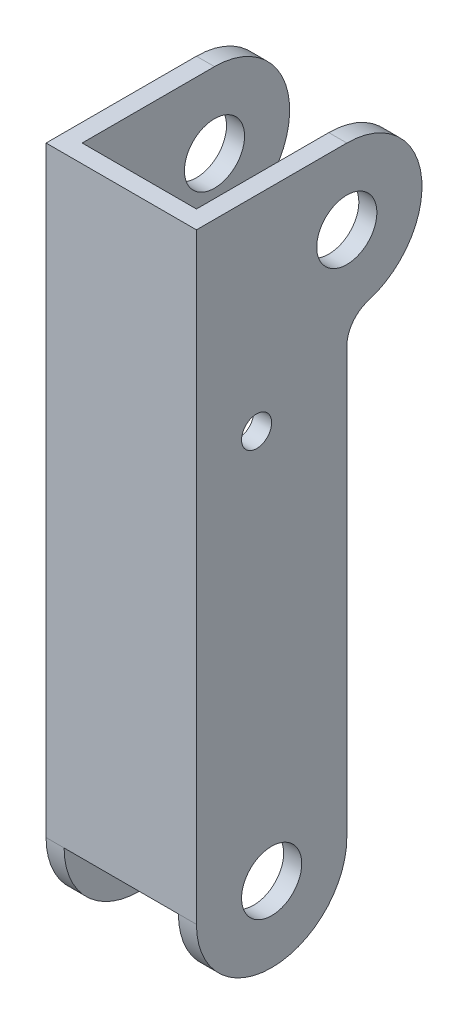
ISO-10303-21;
HEADER;
FILE_DESCRIPTION(('STEP AP214'),'2;1');
FILE_NAME('part.step','',(''),(''),'','','');
FILE_SCHEMA(('AUTOMOTIVE_DESIGN { 1 0 10303 214 1 1 1 1 }'));
ENDSEC;
DATA;
#1=APPLICATION_CONTEXT('core data for automotive mechanical design processes');
#2=APPLICATION_PROTOCOL_DEFINITION('international standard','automotive_design',2000,#1);
#3=PRODUCT_CONTEXT('',#1,'mechanical');
#4=PRODUCT('Part','Part','',(#3));
#5=PRODUCT_RELATED_PRODUCT_CATEGORY('part','',(#4));
#6=PRODUCT_DEFINITION_FORMATION('','',#4);
#7=PRODUCT_DEFINITION_CONTEXT('part definition',#1,'design');
#8=PRODUCT_DEFINITION('design','',#6,#7);
#9=PRODUCT_DEFINITION_SHAPE('','',#8);
#10=(LENGTH_UNIT() NAMED_UNIT(*) SI_UNIT(.MILLI.,.METRE.));
#11=(NAMED_UNIT(*) PLANE_ANGLE_UNIT() SI_UNIT($,.RADIAN.));
#12=(NAMED_UNIT(*) SI_UNIT($,.STERADIAN.) SOLID_ANGLE_UNIT());
#13=UNCERTAINTY_MEASURE_WITH_UNIT(LENGTH_MEASURE(1.E-05),#10,'distance_accuracy_value','');
#14=(GEOMETRIC_REPRESENTATION_CONTEXT(3) GLOBAL_UNCERTAINTY_ASSIGNED_CONTEXT((#13)) GLOBAL_UNIT_ASSIGNED_CONTEXT((#10,
#11,#12)) REPRESENTATION_CONTEXT('',''));
#15=CARTESIAN_POINT('',(0.,0.,0.));
#16=DIRECTION('',(0.,0.,1.));
#17=DIRECTION('',(1.,0.,0.));
#18=AXIS2_PLACEMENT_3D('',#15,#16,#17);
#19=CARTESIAN_POINT('',(6.,175.,-25.));
#20=DIRECTION('',(1.,0.,0.));
#21=DIRECTION('',(0.,0.,-1.));
#22=AXIS2_PLACEMENT_3D('',#19,#20,#21);
#23=PLANE('',#22);
#24=CARTESIAN_POINT('',(6.00000000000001,132.,5.00000000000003));
#25=DIRECTION('',(1.,0.,0.));
#26=DIRECTION('',(0.,0.,-1.));
#27=AXIS2_PLACEMENT_3D('',#24,#25,#26);
#28=CIRCLE('',#27,5.);
#29=CARTESIAN_POINT('',(6.00000000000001,132.,0.));
#30=VERTEX_POINT('',#29);
#31=EDGE_CURVE('E771',#30,#30,#28,.T.);
#32=ORIENTED_EDGE('',*,*,#31,.F.);
#33=EDGE_LOOP('',(#32));
#34=FACE_BOUND('',#33,.T.);
#35=DIRECTION('',(0.,0.,-1.));
#36=VECTOR('',#35,1.);
#37=CARTESIAN_POINT('',(6.,0.,-25.));
#38=LINE('',#37,#36);
#39=CARTESIAN_POINT('',(6.,0.,25.));
#40=VERTEX_POINT('',#39);
#41=CARTESIAN_POINT('',(6.,0.,19.));
#42=VERTEX_POINT('',#41);
#43=EDGE_CURVE('E321',#40,#42,#38,.T.);
#44=ORIENTED_EDGE('',*,*,#43,.F.);
#45=CARTESIAN_POINT('',(6.,0.,0.));
#46=DIRECTION('',(1.,0.,0.));
#47=DIRECTION('',(0.,0.,-1.));
#48=AXIS2_PLACEMENT_3D('',#45,#46,#47);
#49=CIRCLE('',#48,25.);
#50=CARTESIAN_POINT('',(6.,0.,-25.));
#51=VERTEX_POINT('',#50);
#52=EDGE_CURVE('E492',#40,#51,#49,.T.);
#53=ORIENTED_EDGE('',*,*,#52,.T.);
#54=DIRECTION('',(0.,1.,0.));
#55=VECTOR('',#54,1.);
#56=CARTESIAN_POINT('',(6.,0.,-25.));
#57=LINE('',#56,#55);
#58=CARTESIAN_POINT('',(6.,141.458980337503,-25.));
#59=VERTEX_POINT('',#58);
#60=EDGE_CURVE('E500',#51,#59,#57,.T.);
#61=ORIENTED_EDGE('',*,*,#60,.T.);
#62=CARTESIAN_POINT('',(6.,141.458980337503,-35.));
#63=DIRECTION('',(-1.,0.,0.));
#64=DIRECTION('',(0.,0.,-1.));
#65=AXIS2_PLACEMENT_3D('',#62,#63,#64);
#66=CIRCLE('',#65,10.);
#67=CARTESIAN_POINT('',(6.,151.042128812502,-32.1428571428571));
#68=VERTEX_POINT('',#67);
#69=EDGE_CURVE('E497',#59,#68,#66,.T.);
#70=ORIENTED_EDGE('',*,*,#69,.T.);
#71=CARTESIAN_POINT('',(6.,175.,-25.));
#72=DIRECTION('',(1.,0.,0.));
#73=DIRECTION('',(0.,0.,-1.));
#74=AXIS2_PLACEMENT_3D('',#71,#72,#73);
#75=CIRCLE('',#74,25.);
#76=CARTESIAN_POINT('',(6.,200.,-25.));
#77=VERTEX_POINT('',#76);
#78=EDGE_CURVE('E486',#68,#77,#75,.T.);
#79=ORIENTED_EDGE('',*,*,#78,.T.);
#80=DIRECTION('',(0.,0.,1.));
#81=VECTOR('',#80,1.);
#82=CARTESIAN_POINT('',(6.,200.,-25.));
#83=LINE('',#82,#81);
#84=CARTESIAN_POINT('',(6.,200.,19.));
#85=VERTEX_POINT('',#84);
#86=EDGE_CURVE('E493',#77,#85,#83,.T.);
#87=ORIENTED_EDGE('',*,*,#86,.T.);
#88=DIRECTION('',(0.,1.,0.));
#89=VECTOR('',#88,1.);
#90=CARTESIAN_POINT('',(6.,175.,19.));
#91=LINE('',#90,#89);
#92=EDGE_CURVE('E529',#42,#85,#91,.T.);
#93=ORIENTED_EDGE('',*,*,#92,.F.);
#94=EDGE_LOOP('',(#44,#53,#61,#70,#79,#87,#93));
#95=FACE_BOUND('',#94,.T.);
#96=CARTESIAN_POINT('',(6.,0.,0.));
#97=DIRECTION('',(1.,0.,0.));
#98=DIRECTION('',(0.,0.,-1.));
#99=AXIS2_PLACEMENT_3D('',#96,#97,#98);
#100=CIRCLE('',#99,10.);
#101=CARTESIAN_POINT('',(6.,0.,-10.));
#102=VERTEX_POINT('',#101);
#103=EDGE_CURVE('E485',#102,#102,#100,.T.);
#104=ORIENTED_EDGE('',*,*,#103,.F.);
#105=EDGE_LOOP('',(#104));
#106=FACE_BOUND('',#105,.T.);
#107=CARTESIAN_POINT('',(6.,175.,-25.));
#108=DIRECTION('',(1.,0.,0.));
#109=DIRECTION('',(0.,0.,-1.));
#110=AXIS2_PLACEMENT_3D('',#107,#108,#109);
#111=CIRCLE('',#110,10.);
#112=CARTESIAN_POINT('',(6.,175.,-35.));
#113=VERTEX_POINT('',#112);
#114=EDGE_CURVE('E477',#113,#113,#111,.T.);
#115=ORIENTED_EDGE('',*,*,#114,.F.);
#116=EDGE_LOOP('',(#115));
#117=FACE_BOUND('',#116,.T.);
#118=ADVANCED_FACE('F314',(#34,#95,#106,#117),#23,.T.);
#119=CARTESIAN_POINT('',(0.,175.,-25.));
#120=DIRECTION('',(1.,0.,0.));
#121=DIRECTION('',(0.,0.,-1.));
#122=AXIS2_PLACEMENT_3D('',#119,#120,#121);
#123=PLANE('',#122);
#124=CARTESIAN_POINT('',(0.,132.,5.00000000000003));
#125=DIRECTION('',(-1.,0.,0.));
#126=DIRECTION('',(0.,0.,1.));
#127=AXIS2_PLACEMENT_3D('',#124,#125,#126);
#128=CIRCLE('',#127,5.);
#129=CARTESIAN_POINT('',(0.,132.,10.));
#130=VERTEX_POINT('',#129);
#131=EDGE_CURVE('E778',#130,#130,#128,.T.);
#132=ORIENTED_EDGE('',*,*,#131,.F.);
#133=EDGE_LOOP('',(#132));
#134=FACE_BOUND('',#133,.T.);
#135=DIRECTION('',(0.,-1.,0.));
#136=VECTOR('',#135,1.);
#137=CARTESIAN_POINT('',(0.,0.,25.));
#138=LINE('',#137,#136);
#139=CARTESIAN_POINT('',(0.,200.,25.));
#140=VERTEX_POINT('',#139);
#141=CARTESIAN_POINT('',(0.,0.,25.));
#142=VERTEX_POINT('',#141);
#143=EDGE_CURVE('E510',#140,#142,#138,.T.);
#144=ORIENTED_EDGE('',*,*,#143,.F.);
#145=DIRECTION('',(0.,0.,1.));
#146=VECTOR('',#145,1.);
#147=CARTESIAN_POINT('',(0.,200.,-25.));
#148=LINE('',#147,#146);
#149=CARTESIAN_POINT('',(0.,200.,-25.));
#150=VERTEX_POINT('',#149);
#151=EDGE_CURVE('E502',#150,#140,#148,.T.);
#152=ORIENTED_EDGE('',*,*,#151,.F.);
#153=CARTESIAN_POINT('',(0.,175.,-25.));
#154=DIRECTION('',(1.,0.,0.));
#155=DIRECTION('',(0.,0.,-1.));
#156=AXIS2_PLACEMENT_3D('',#153,#154,#155);
#157=CIRCLE('',#156,25.);
#158=CARTESIAN_POINT('',(0.,151.042128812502,-32.1428571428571));
#159=VERTEX_POINT('',#158);
#160=EDGE_CURVE('E484',#159,#150,#157,.T.);
#161=ORIENTED_EDGE('',*,*,#160,.F.);
#162=CARTESIAN_POINT('',(0.,141.458980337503,-35.));
#163=DIRECTION('',(-1.,0.,0.));
#164=DIRECTION('',(0.,0.,-1.));
#165=AXIS2_PLACEMENT_3D('',#162,#163,#164);
#166=CIRCLE('',#165,10.);
#167=CARTESIAN_POINT('',(0.,141.458980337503,-25.));
#168=VERTEX_POINT('',#167);
#169=EDGE_CURVE('E495',#168,#159,#166,.T.);
#170=ORIENTED_EDGE('',*,*,#169,.F.);
#171=DIRECTION('',(0.,1.,0.));
#172=VECTOR('',#171,1.);
#173=CARTESIAN_POINT('',(0.,0.,-25.));
#174=LINE('',#173,#172);
#175=CARTESIAN_POINT('',(0.,0.,-25.));
#176=VERTEX_POINT('',#175);
#177=EDGE_CURVE('E512',#176,#168,#174,.T.);
#178=ORIENTED_EDGE('',*,*,#177,.F.);
#179=CARTESIAN_POINT('',(0.,0.,0.));
#180=DIRECTION('',(1.,0.,0.));
#181=DIRECTION('',(0.,0.,-1.));
#182=AXIS2_PLACEMENT_3D('',#179,#180,#181);
#183=CIRCLE('',#182,25.);
#184=EDGE_CURVE('E508',#142,#176,#183,.T.);
#185=ORIENTED_EDGE('',*,*,#184,.F.);
#186=EDGE_LOOP('',(#144,#152,#161,#170,#178,#185));
#187=FACE_BOUND('',#186,.T.);
#188=CARTESIAN_POINT('',(0.,175.,-25.));
#189=DIRECTION('',(1.,0.,0.));
#190=DIRECTION('',(0.,0.,-1.));
#191=AXIS2_PLACEMENT_3D('',#188,#189,#190);
#192=CIRCLE('',#191,10.);
#193=CARTESIAN_POINT('',(0.,175.,-35.));
#194=VERTEX_POINT('',#193);
#195=EDGE_CURVE('E473',#194,#194,#192,.T.);
#196=ORIENTED_EDGE('',*,*,#195,.T.);
#197=EDGE_LOOP('',(#196));
#198=FACE_BOUND('',#197,.T.);
#199=CARTESIAN_POINT('',(0.,0.,0.));
#200=DIRECTION('',(1.,0.,0.));
#201=DIRECTION('',(0.,0.,-1.));
#202=AXIS2_PLACEMENT_3D('',#199,#200,#201);
#203=CIRCLE('',#202,10.);
#204=CARTESIAN_POINT('',(0.,0.,-10.));
#205=VERTEX_POINT('',#204);
#206=EDGE_CURVE('E476',#205,#205,#203,.T.);
#207=ORIENTED_EDGE('',*,*,#206,.T.);
#208=EDGE_LOOP('',(#207));
#209=FACE_BOUND('',#208,.T.);
#210=ADVANCED_FACE('F574',(#134,#187,#198,#209),#123,.F.);
#211=CARTESIAN_POINT('',(6.,175.,-25.));
#212=DIRECTION('',(-1.,0.,0.));
#213=DIRECTION('',(0.,0.,1.));
#214=AXIS2_PLACEMENT_3D('',#211,#212,#213);
#215=CYLINDRICAL_SURFACE('',#214,25.);
#216=ORIENTED_EDGE('',*,*,#160,.T.);
#217=DIRECTION('',(-1.,0.,0.));
#218=VECTOR('',#217,1.);
#219=CARTESIAN_POINT('',(6.,200.,-25.));
#220=LINE('',#219,#218);
#221=EDGE_CURVE('E530',#77,#150,#220,.T.);
#222=ORIENTED_EDGE('',*,*,#221,.F.);
#223=ORIENTED_EDGE('',*,*,#78,.F.);
#224=DIRECTION('',(-1.,0.,0.));
#225=VECTOR('',#224,1.);
#226=CARTESIAN_POINT('',(6.,151.042128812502,-32.1428571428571));
#227=LINE('',#226,#225);
#228=EDGE_CURVE('E501',#68,#159,#227,.T.);
#229=ORIENTED_EDGE('',*,*,#228,.T.);
#230=EDGE_LOOP('',(#216,#222,#223,#229));
#231=FACE_BOUND('',#230,.T.);
#232=ADVANCED_FACE('F320',(#231),#215,.T.);
#233=CARTESIAN_POINT('',(6.,200.,-25.));
#234=DIRECTION('',(0.,-1.,0.));
#235=DIRECTION('',(0.,0.,-1.));
#236=AXIS2_PLACEMENT_3D('',#233,#234,#235);
#237=PLANE('',#236);
#238=DIRECTION('',(0.,0.,1.));
#239=VECTOR('',#238,1.);
#240=CARTESIAN_POINT('',(50.,200.,19.));
#241=LINE('',#240,#239);
#242=CARTESIAN_POINT('',(50.,200.,-25.));
#243=VERTEX_POINT('',#242);
#244=CARTESIAN_POINT('',(50.,200.,25.));
#245=VERTEX_POINT('',#244);
#246=EDGE_CURVE('E469',#243,#245,#241,.T.);
#247=ORIENTED_EDGE('',*,*,#246,.F.);
#248=DIRECTION('',(1.,0.,0.));
#249=VECTOR('',#248,1.);
#250=CARTESIAN_POINT('',(44.,200.,-25.));
#251=LINE('',#250,#249);
#252=CARTESIAN_POINT('',(44.,200.,-25.));
#253=VERTEX_POINT('',#252);
#254=EDGE_CURVE('E447',#253,#243,#251,.T.);
#255=ORIENTED_EDGE('',*,*,#254,.F.);
#256=DIRECTION('',(0.,0.,1.));
#257=VECTOR('',#256,1.);
#258=CARTESIAN_POINT('',(44.,200.,-25.));
#259=LINE('',#258,#257);
#260=CARTESIAN_POINT('',(44.,200.,19.));
#261=VERTEX_POINT('',#260);
#262=EDGE_CURVE('E433',#253,#261,#259,.T.);
#263=ORIENTED_EDGE('',*,*,#262,.T.);
#264=DIRECTION('',(-1.,0.,0.));
#265=VECTOR('',#264,1.);
#266=CARTESIAN_POINT('',(0.,200.,19.));
#267=LINE('',#266,#265);
#268=EDGE_CURVE('E467',#261,#85,#267,.T.);
#269=ORIENTED_EDGE('',*,*,#268,.T.);
#270=ORIENTED_EDGE('',*,*,#86,.F.);
#271=ORIENTED_EDGE('',*,*,#221,.T.);
#272=ORIENTED_EDGE('',*,*,#151,.T.);
#273=DIRECTION('',(-1.,0.,0.));
#274=VECTOR('',#273,1.);
#275=CARTESIAN_POINT('',(6.,200.,25.));
#276=LINE('',#275,#274);
#277=EDGE_CURVE('E523',#245,#140,#276,.T.);
#278=ORIENTED_EDGE('',*,*,#277,.F.);
#279=EDGE_LOOP('',(#247,#255,#263,#269,#270,#271,#272,#278));
#280=FACE_BOUND('',#279,.T.);
#281=ADVANCED_FACE('F545',(#280),#237,.F.);
#282=CARTESIAN_POINT('',(6.,0.,25.));
#283=DIRECTION('',(0.,0.,-1.));
#284=DIRECTION('',(0.,1.,0.));
#285=AXIS2_PLACEMENT_3D('',#282,#283,#284);
#286=PLANE('',#285);
#287=ORIENTED_EDGE('',*,*,#277,.T.);
#288=ORIENTED_EDGE('',*,*,#143,.T.);
#289=DIRECTION('',(-1.,0.,0.));
#290=VECTOR('',#289,1.);
#291=CARTESIAN_POINT('',(6.,0.,25.));
#292=LINE('',#291,#290);
#293=EDGE_CURVE('E525',#40,#142,#292,.T.);
#294=ORIENTED_EDGE('',*,*,#293,.F.);
#295=DIRECTION('',(1.,0.,0.));
#296=VECTOR('',#295,1.);
#297=CARTESIAN_POINT('',(0.,0.,25.));
#298=LINE('',#297,#296);
#299=CARTESIAN_POINT('',(44.,0.,25.));
#300=VERTEX_POINT('',#299);
#301=EDGE_CURVE('E463',#40,#300,#298,.T.);
#302=ORIENTED_EDGE('',*,*,#301,.T.);
#303=DIRECTION('',(1.,0.,0.));
#304=VECTOR('',#303,1.);
#305=CARTESIAN_POINT('',(44.,0.,25.));
#306=LINE('',#305,#304);
#307=CARTESIAN_POINT('',(50.,0.,25.));
#308=VERTEX_POINT('',#307);
#309=EDGE_CURVE('E460',#300,#308,#306,.T.);
#310=ORIENTED_EDGE('',*,*,#309,.T.);
#311=DIRECTION('',(0.,1.,0.));
#312=VECTOR('',#311,1.);
#313=CARTESIAN_POINT('',(50.,0.,25.));
#314=LINE('',#313,#312);
#315=EDGE_CURVE('E470',#308,#245,#314,.T.);
#316=ORIENTED_EDGE('',*,*,#315,.T.);
#317=EDGE_LOOP('',(#287,#288,#294,#302,#310,#316));
#318=FACE_BOUND('',#317,.T.);
#319=ADVANCED_FACE('F554',(#318),#286,.F.);
#320=CARTESIAN_POINT('',(6.,0.,0.));
#321=DIRECTION('',(-1.,0.,0.));
#322=DIRECTION('',(0.,0.,1.));
#323=AXIS2_PLACEMENT_3D('',#320,#321,#322);
#324=CYLINDRICAL_SURFACE('',#323,25.);
#325=ORIENTED_EDGE('',*,*,#184,.T.);
#326=DIRECTION('',(-1.,0.,0.));
#327=VECTOR('',#326,1.);
#328=CARTESIAN_POINT('',(6.,0.,-25.));
#329=LINE('',#328,#327);
#330=EDGE_CURVE('E516',#51,#176,#329,.T.);
#331=ORIENTED_EDGE('',*,*,#330,.F.);
#332=ORIENTED_EDGE('',*,*,#52,.F.);
#333=ORIENTED_EDGE('',*,*,#293,.T.);
#334=EDGE_LOOP('',(#325,#331,#332,#333));
#335=FACE_BOUND('',#334,.T.);
#336=ADVANCED_FACE('F561',(#335),#324,.T.);
#337=CARTESIAN_POINT('',(6.,0.,-25.));
#338=DIRECTION('',(0.,0.,1.));
#339=DIRECTION('',(0.,-1.,0.));
#340=AXIS2_PLACEMENT_3D('',#337,#338,#339);
#341=PLANE('',#340);
#342=ORIENTED_EDGE('',*,*,#177,.T.);
#343=DIRECTION('',(-1.,0.,0.));
#344=VECTOR('',#343,1.);
#345=CARTESIAN_POINT('',(6.,141.458980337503,-25.));
#346=LINE('',#345,#344);
#347=EDGE_CURVE('E517',#59,#168,#346,.T.);
#348=ORIENTED_EDGE('',*,*,#347,.F.);
#349=ORIENTED_EDGE('',*,*,#60,.F.);
#350=ORIENTED_EDGE('',*,*,#330,.T.);
#351=EDGE_LOOP('',(#342,#348,#349,#350));
#352=FACE_BOUND('',#351,.T.);
#353=ADVANCED_FACE('F570',(#352),#341,.F.);
#354=CARTESIAN_POINT('',(6.,141.458980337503,-35.));
#355=DIRECTION('',(-1.,0.,0.));
#356=DIRECTION('',(0.,0.,1.));
#357=AXIS2_PLACEMENT_3D('',#354,#355,#356);
#358=CYLINDRICAL_SURFACE('',#357,10.);
#359=ORIENTED_EDGE('',*,*,#169,.T.);
#360=ORIENTED_EDGE('',*,*,#228,.F.);
#361=ORIENTED_EDGE('',*,*,#69,.F.);
#362=ORIENTED_EDGE('',*,*,#347,.T.);
#363=EDGE_LOOP('',(#359,#360,#361,#362));
#364=FACE_BOUND('',#363,.T.);
#365=ADVANCED_FACE('F571',(#364),#358,.F.);
#366=CARTESIAN_POINT('',(6.,0.,0.));
#367=DIRECTION('',(-1.,0.,0.));
#368=DIRECTION('',(0.,0.,1.));
#369=AXIS2_PLACEMENT_3D('',#366,#367,#368);
#370=CYLINDRICAL_SURFACE('',#369,10.);
#371=ORIENTED_EDGE('',*,*,#103,.T.);
#372=EDGE_LOOP('',(#371));
#373=FACE_BOUND('',#372,.T.);
#374=ORIENTED_EDGE('',*,*,#206,.F.);
#375=EDGE_LOOP('',(#374));
#376=FACE_BOUND('',#375,.T.);
#377=ADVANCED_FACE('F581',(#373,#376),#370,.F.);
#378=CARTESIAN_POINT('',(6.,175.,-25.));
#379=DIRECTION('',(-1.,0.,0.));
#380=DIRECTION('',(0.,0.,1.));
#381=AXIS2_PLACEMENT_3D('',#378,#379,#380);
#382=CYLINDRICAL_SURFACE('',#381,10.);
#383=ORIENTED_EDGE('',*,*,#114,.T.);
#384=EDGE_LOOP('',(#383));
#385=FACE_BOUND('',#384,.T.);
#386=ORIENTED_EDGE('',*,*,#195,.F.);
#387=EDGE_LOOP('',(#386));
#388=FACE_BOUND('',#387,.T.);
#389=ADVANCED_FACE('F587',(#385,#388),#382,.F.);
#390=CARTESIAN_POINT('',(50.,0.,19.));
#391=DIRECTION('',(1.,0.,0.));
#392=DIRECTION('',(0.,1.,0.));
#393=AXIS2_PLACEMENT_3D('',#390,#391,#392);
#394=PLANE('',#393);
#395=CARTESIAN_POINT('',(50.,132.,5.00000000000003));
#396=DIRECTION('',(1.,0.,0.));
#397=DIRECTION('',(0.,1.,0.));
#398=AXIS2_PLACEMENT_3D('',#395,#396,#397);
#399=CIRCLE('',#398,5.);
#400=CARTESIAN_POINT('',(50.,137.,5.00000000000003));
#401=VERTEX_POINT('',#400);
#402=EDGE_CURVE('E780',#401,#401,#399,.T.);
#403=ORIENTED_EDGE('',*,*,#402,.F.);
#404=EDGE_LOOP('',(#403));
#405=FACE_BOUND('',#404,.T.);
#406=ORIENTED_EDGE('',*,*,#315,.F.);
#407=CARTESIAN_POINT('',(50.,0.,0.));
#408=DIRECTION('',(1.,0.,0.));
#409=DIRECTION('',(0.,0.,-1.));
#410=AXIS2_PLACEMENT_3D('',#407,#408,#409);
#411=CIRCLE('',#410,25.);
#412=CARTESIAN_POINT('',(50.,0.,-25.));
#413=VERTEX_POINT('',#412);
#414=EDGE_CURVE('E432',#308,#413,#411,.T.);
#415=ORIENTED_EDGE('',*,*,#414,.T.);
#416=DIRECTION('',(0.,1.,0.));
#417=VECTOR('',#416,1.);
#418=CARTESIAN_POINT('',(50.,0.,-25.));
#419=LINE('',#418,#417);
#420=CARTESIAN_POINT('',(50.,141.458980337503,-25.));
#421=VERTEX_POINT('',#420);
#422=EDGE_CURVE('E452',#413,#421,#419,.T.);
#423=ORIENTED_EDGE('',*,*,#422,.T.);
#424=CARTESIAN_POINT('',(50.,141.458980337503,-35.));
#425=DIRECTION('',(-1.,0.,0.));
#426=DIRECTION('',(0.,0.,-1.));
#427=AXIS2_PLACEMENT_3D('',#424,#425,#426);
#428=CIRCLE('',#427,10.);
#429=CARTESIAN_POINT('',(50.,151.042128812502,-32.1428571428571));
#430=VERTEX_POINT('',#429);
#431=EDGE_CURVE('E449',#421,#430,#428,.T.);
#432=ORIENTED_EDGE('',*,*,#431,.T.);
#433=CARTESIAN_POINT('',(50.,175.,-25.));
#434=DIRECTION('',(1.,0.,0.));
#435=DIRECTION('',(0.,0.,-1.));
#436=AXIS2_PLACEMENT_3D('',#433,#434,#435);
#437=CIRCLE('',#436,25.);
#438=EDGE_CURVE('E418',#430,#243,#437,.T.);
#439=ORIENTED_EDGE('',*,*,#438,.T.);
#440=ORIENTED_EDGE('',*,*,#246,.T.);
#441=EDGE_LOOP('',(#406,#415,#423,#432,#439,#440));
#442=FACE_BOUND('',#441,.T.);
#443=CARTESIAN_POINT('',(50.,175.,-25.));
#444=DIRECTION('',(1.,0.,0.));
#445=DIRECTION('',(0.,0.,-1.));
#446=AXIS2_PLACEMENT_3D('',#443,#444,#445);
#447=CIRCLE('',#446,10.);
#448=CARTESIAN_POINT('',(50.,175.,-35.));
#449=VERTEX_POINT('',#448);
#450=EDGE_CURVE('E772',#449,#449,#447,.T.);
#451=ORIENTED_EDGE('',*,*,#450,.F.);
#452=EDGE_LOOP('',(#451));
#453=FACE_BOUND('',#452,.T.);
#454=CARTESIAN_POINT('',(50.,0.,0.));
#455=DIRECTION('',(1.,0.,0.));
#456=DIRECTION('',(0.,0.,-1.));
#457=AXIS2_PLACEMENT_3D('',#454,#455,#456);
#458=CIRCLE('',#457,10.);
#459=CARTESIAN_POINT('',(50.,0.,-10.));
#460=VERTEX_POINT('',#459);
#461=EDGE_CURVE('E770',#460,#460,#458,.T.);
#462=ORIENTED_EDGE('',*,*,#461,.F.);
#463=EDGE_LOOP('',(#462));
#464=FACE_BOUND('',#463,.T.);
#465=ADVANCED_FACE('F543',(#405,#442,#453,#464),#394,.T.);
#466=CARTESIAN_POINT('',(0.,0.,19.));
#467=DIRECTION('',(0.,-1.,0.));
#468=DIRECTION('',(1.,0.,0.));
#469=AXIS2_PLACEMENT_3D('',#466,#467,#468);
#470=PLANE('',#469);
#471=DIRECTION('',(0.,0.,-1.));
#472=VECTOR('',#471,1.);
#473=CARTESIAN_POINT('',(44.,0.,19.));
#474=LINE('',#473,#472);
#475=CARTESIAN_POINT('',(44.,0.,19.));
#476=VERTEX_POINT('',#475);
#477=EDGE_CURVE('E331',#300,#476,#474,.T.);
#478=ORIENTED_EDGE('',*,*,#477,.F.);
#479=ORIENTED_EDGE('',*,*,#301,.F.);
#480=ORIENTED_EDGE('',*,*,#43,.T.);
#481=DIRECTION('',(1.,0.,0.));
#482=VECTOR('',#481,1.);
#483=CARTESIAN_POINT('',(0.,0.,19.));
#484=LINE('',#483,#482);
#485=EDGE_CURVE('E462',#42,#476,#484,.T.);
#486=ORIENTED_EDGE('',*,*,#485,.T.);
#487=EDGE_LOOP('',(#478,#479,#480,#486));
#488=FACE_BOUND('',#487,.T.);
#489=ADVANCED_FACE('F534',(#488),#470,.T.);
#490=CARTESIAN_POINT('',(0.,0.,19.));
#491=DIRECTION('',(0.,0.,-1.));
#492=DIRECTION('',(-1.,0.,0.));
#493=AXIS2_PLACEMENT_3D('',#490,#491,#492);
#494=PLANE('',#493);
#495=DIRECTION('',(0.,1.,0.));
#496=VECTOR('',#495,1.);
#497=CARTESIAN_POINT('',(44.,0.,19.));
#498=LINE('',#497,#496);
#499=EDGE_CURVE('E12',#476,#261,#498,.T.);
#500=ORIENTED_EDGE('',*,*,#499,.F.);
#501=ORIENTED_EDGE('',*,*,#485,.F.);
#502=ORIENTED_EDGE('',*,*,#92,.T.);
#503=ORIENTED_EDGE('',*,*,#268,.F.);
#504=EDGE_LOOP('',(#500,#501,#502,#503));
#505=FACE_BOUND('',#504,.T.);
#506=ADVANCED_FACE('F540',(#505),#494,.T.);
#507=CARTESIAN_POINT('',(44.,175.,-25.));
#508=DIRECTION('',(1.,0.,0.));
#509=DIRECTION('',(0.,0.,-1.));
#510=AXIS2_PLACEMENT_3D('',#507,#508,#509);
#511=CYLINDRICAL_SURFACE('',#510,25.);
#512=ORIENTED_EDGE('',*,*,#438,.F.);
#513=DIRECTION('',(1.,0.,0.));
#514=VECTOR('',#513,1.);
#515=CARTESIAN_POINT('',(44.,151.042128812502,-32.1428571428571));
#516=LINE('',#515,#514);
#517=CARTESIAN_POINT('',(44.,151.042128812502,-32.1428571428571));
#518=VERTEX_POINT('',#517);
#519=EDGE_CURVE('E412',#518,#430,#516,.T.);
#520=ORIENTED_EDGE('',*,*,#519,.F.);
#521=CARTESIAN_POINT('',(44.,175.,-25.));
#522=DIRECTION('',(1.,0.,0.));
#523=DIRECTION('',(0.,0.,-1.));
#524=AXIS2_PLACEMENT_3D('',#521,#522,#523);
#525=CIRCLE('',#524,25.);
#526=EDGE_CURVE('E413',#518,#253,#525,.T.);
#527=ORIENTED_EDGE('',*,*,#526,.T.);
#528=ORIENTED_EDGE('',*,*,#254,.T.);
#529=EDGE_LOOP('',(#512,#520,#527,#528));
#530=FACE_BOUND('',#529,.T.);
#531=ADVANCED_FACE('F414',(#530),#511,.T.);
#532=CARTESIAN_POINT('',(44.,141.458980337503,-35.));
#533=DIRECTION('',(1.,0.,0.));
#534=DIRECTION('',(0.,0.,-1.));
#535=AXIS2_PLACEMENT_3D('',#532,#533,#534);
#536=CYLINDRICAL_SURFACE('',#535,10.);
#537=ORIENTED_EDGE('',*,*,#431,.F.);
#538=DIRECTION('',(1.,0.,0.));
#539=VECTOR('',#538,1.);
#540=CARTESIAN_POINT('',(44.,141.458980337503,-25.));
#541=LINE('',#540,#539);
#542=CARTESIAN_POINT('',(44.,141.458980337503,-25.));
#543=VERTEX_POINT('',#542);
#544=EDGE_CURVE('E421',#543,#421,#541,.T.);
#545=ORIENTED_EDGE('',*,*,#544,.F.);
#546=CARTESIAN_POINT('',(44.,141.458980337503,-35.));
#547=DIRECTION('',(-1.,0.,0.));
#548=DIRECTION('',(0.,0.,-1.));
#549=AXIS2_PLACEMENT_3D('',#546,#547,#548);
#550=CIRCLE('',#549,10.);
#551=EDGE_CURVE('E427',#543,#518,#550,.T.);
#552=ORIENTED_EDGE('',*,*,#551,.T.);
#553=ORIENTED_EDGE('',*,*,#519,.T.);
#554=EDGE_LOOP('',(#537,#545,#552,#553));
#555=FACE_BOUND('',#554,.T.);
#556=ADVANCED_FACE('F436',(#555),#536,.F.);
#557=CARTESIAN_POINT('',(44.,0.,-25.));
#558=DIRECTION('',(0.,0.,-1.));
#559=DIRECTION('',(0.,1.,0.));
#560=AXIS2_PLACEMENT_3D('',#557,#558,#559);
#561=PLANE('',#560);
#562=ORIENTED_EDGE('',*,*,#422,.F.);
#563=DIRECTION('',(1.,0.,0.));
#564=VECTOR('',#563,1.);
#565=CARTESIAN_POINT('',(44.,0.,-25.));
#566=LINE('',#565,#564);
#567=CARTESIAN_POINT('',(44.,0.,-25.));
#568=VERTEX_POINT('',#567);
#569=EDGE_CURVE('E456',#568,#413,#566,.T.);
#570=ORIENTED_EDGE('',*,*,#569,.F.);
#571=DIRECTION('',(0.,1.,0.));
#572=VECTOR('',#571,1.);
#573=CARTESIAN_POINT('',(44.,0.,-25.));
#574=LINE('',#573,#572);
#575=EDGE_CURVE('E440',#568,#543,#574,.T.);
#576=ORIENTED_EDGE('',*,*,#575,.T.);
#577=ORIENTED_EDGE('',*,*,#544,.T.);
#578=EDGE_LOOP('',(#562,#570,#576,#577));
#579=FACE_BOUND('',#578,.T.);
#580=ADVANCED_FACE('F549',(#579),#561,.T.);
#581=CARTESIAN_POINT('',(44.,0.,0.));
#582=DIRECTION('',(1.,0.,0.));
#583=DIRECTION('',(0.,0.,-1.));
#584=AXIS2_PLACEMENT_3D('',#581,#582,#583);
#585=CYLINDRICAL_SURFACE('',#584,25.);
#586=ORIENTED_EDGE('',*,*,#414,.F.);
#587=ORIENTED_EDGE('',*,*,#309,.F.);
#588=CARTESIAN_POINT('',(44.,0.,0.));
#589=DIRECTION('',(1.,0.,0.));
#590=DIRECTION('',(0.,0.,-1.));
#591=AXIS2_PLACEMENT_3D('',#588,#589,#590);
#592=CIRCLE('',#591,25.);
#593=EDGE_CURVE('E437',#300,#568,#592,.T.);
#594=ORIENTED_EDGE('',*,*,#593,.T.);
#595=ORIENTED_EDGE('',*,*,#569,.T.);
#596=EDGE_LOOP('',(#586,#587,#594,#595));
#597=FACE_BOUND('',#596,.T.);
#598=ADVANCED_FACE('F551',(#597),#585,.T.);
#599=CARTESIAN_POINT('',(44.,175.,-25.));
#600=DIRECTION('',(-1.,0.,0.));
#601=DIRECTION('',(0.,0.,-1.));
#602=AXIS2_PLACEMENT_3D('',#599,#600,#601);
#603=PLANE('',#602);
#604=CARTESIAN_POINT('',(44.,132.,5.00000000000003));
#605=DIRECTION('',(-1.,0.,0.));
#606=DIRECTION('',(0.,0.,1.));
#607=AXIS2_PLACEMENT_3D('',#604,#605,#606);
#608=CIRCLE('',#607,5.);
#609=CARTESIAN_POINT('',(44.,132.,10.));
#610=VERTEX_POINT('',#609);
#611=EDGE_CURVE('E316',#610,#610,#608,.T.);
#612=ORIENTED_EDGE('',*,*,#611,.F.);
#613=EDGE_LOOP('',(#612));
#614=FACE_BOUND('',#613,.T.);
#615=CARTESIAN_POINT('',(44.,175.,-25.));
#616=DIRECTION('',(1.,0.,0.));
#617=DIRECTION('',(0.,0.,-1.));
#618=AXIS2_PLACEMENT_3D('',#615,#616,#617);
#619=CIRCLE('',#618,10.);
#620=CARTESIAN_POINT('',(44.,175.,-35.));
#621=VERTEX_POINT('',#620);
#622=EDGE_CURVE('E762',#621,#621,#619,.T.);
#623=ORIENTED_EDGE('',*,*,#622,.T.);
#624=EDGE_LOOP('',(#623));
#625=FACE_BOUND('',#624,.T.);
#626=CARTESIAN_POINT('',(44.,0.,0.));
#627=DIRECTION('',(1.,0.,0.));
#628=DIRECTION('',(0.,0.,-1.));
#629=AXIS2_PLACEMENT_3D('',#626,#627,#628);
#630=CIRCLE('',#629,10.);
#631=CARTESIAN_POINT('',(44.,0.,-10.));
#632=VERTEX_POINT('',#631);
#633=EDGE_CURVE('E446',#632,#632,#630,.T.);
#634=ORIENTED_EDGE('',*,*,#633,.T.);
#635=EDGE_LOOP('',(#634));
#636=FACE_BOUND('',#635,.T.);
#637=ORIENTED_EDGE('',*,*,#593,.F.);
#638=ORIENTED_EDGE('',*,*,#477,.T.);
#639=ORIENTED_EDGE('',*,*,#499,.T.);
#640=ORIENTED_EDGE('',*,*,#262,.F.);
#641=ORIENTED_EDGE('',*,*,#526,.F.);
#642=ORIENTED_EDGE('',*,*,#551,.F.);
#643=ORIENTED_EDGE('',*,*,#575,.F.);
#644=EDGE_LOOP('',(#637,#638,#639,#640,#641,#642,#643));
#645=FACE_BOUND('',#644,.T.);
#646=ADVANCED_FACE('F426',(#614,#625,#636,#645),#603,.T.);
#647=CARTESIAN_POINT('',(44.,0.,0.));
#648=DIRECTION('',(1.,0.,0.));
#649=DIRECTION('',(0.,0.,-1.));
#650=AXIS2_PLACEMENT_3D('',#647,#648,#649);
#651=CYLINDRICAL_SURFACE('',#650,10.);
#652=ORIENTED_EDGE('',*,*,#633,.F.);
#653=EDGE_LOOP('',(#652));
#654=FACE_BOUND('',#653,.T.);
#655=ORIENTED_EDGE('',*,*,#461,.T.);
#656=EDGE_LOOP('',(#655));
#657=FACE_BOUND('',#656,.T.);
#658=ADVANCED_FACE('F717',(#654,#657),#651,.F.);
#659=CARTESIAN_POINT('',(44.,175.,-25.));
#660=DIRECTION('',(1.,0.,0.));
#661=DIRECTION('',(0.,0.,-1.));
#662=AXIS2_PLACEMENT_3D('',#659,#660,#661);
#663=CYLINDRICAL_SURFACE('',#662,10.);
#664=ORIENTED_EDGE('',*,*,#622,.F.);
#665=EDGE_LOOP('',(#664));
#666=FACE_BOUND('',#665,.T.);
#667=ORIENTED_EDGE('',*,*,#450,.T.);
#668=EDGE_LOOP('',(#667));
#669=FACE_BOUND('',#668,.T.);
#670=ADVANCED_FACE('F716',(#666,#669),#663,.F.);
#671=CARTESIAN_POINT('',(90.,132.,5.00000000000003));
#672=DIRECTION('',(-1.,0.,0.));
#673=DIRECTION('',(0.,0.,1.));
#674=AXIS2_PLACEMENT_3D('',#671,#672,#673);
#675=CYLINDRICAL_SURFACE('',#674,5.);
#676=ORIENTED_EDGE('',*,*,#402,.T.);
#677=EDGE_LOOP('',(#676));
#678=FACE_BOUND('',#677,.T.);
#679=ORIENTED_EDGE('',*,*,#611,.T.);
#680=EDGE_LOOP('',(#679));
#681=FACE_BOUND('',#680,.T.);
#682=ADVANCED_FACE('F730',(#678,#681),#675,.F.);
#683=ORIENTED_EDGE('',*,*,#31,.T.);
#684=EDGE_LOOP('',(#683));
#685=FACE_BOUND('',#684,.T.);
#686=ORIENTED_EDGE('',*,*,#131,.T.);
#687=EDGE_LOOP('',(#686));
#688=FACE_BOUND('',#687,.T.);
#689=ADVANCED_FACE('F738',(#685,#688),#675,.F.);
#690=CLOSED_SHELL('',(#118,#210,#232,#281,#319,#336,#353,#365,#377,#389,#465,#489,#506,#531,
#556,#580,#598,#646,#658,#670,#682,#689));
#691=MANIFOLD_SOLID_BREP('B2',#690);
#692=ADVANCED_BREP_SHAPE_REPRESENTATION('',(#18,#691),#14);
#693=SHAPE_DEFINITION_REPRESENTATION(#9,#692);
ENDSEC;
END-ISO-10303-21;
